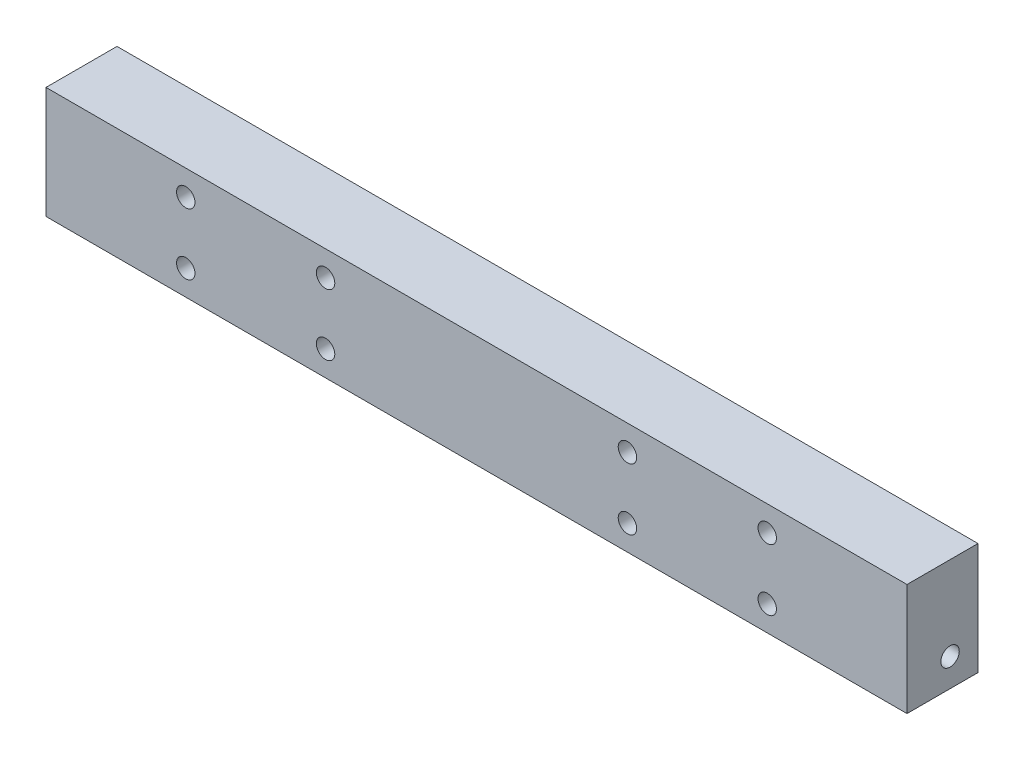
from build123d import *

# Parameters (mm, degrees)
SKETCH1_W           = 154
SKETCH1_H           = 20
BOSS_EXTRUDE1_DEPTH = 12.7
SKETCH2_R           = 1.65
CUT_EXTRUDE1_DEPTH  = 22
SKETCH3_R           = 1.65
CUT_EXTRUDE2_DEPTH  = 79.678396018


with BuildPart() as part:
    # Sketch1 → Boss-Extrude1 (new body)
    with BuildSketch(Plane.XY):
        Rectangle(SKETCH1_W, SKETCH1_H)
    extrude(amount=BOSS_EXTRUDE1_DEPTH)

    # Sketch2 → Cut-Extrude1 (cut)
    with BuildSketch(Plane(origin=(77, 0, 0), x_dir=(0, 0, -1), z_dir=(1, 0, 0))):
        with Locations(Location((-5, -5, 0), (0, 0, 90))):
            Circle(SKETCH2_R)
    cut_extrude1 = extrude(amount=-CUT_EXTRUDE1_DEPTH, mode=Mode.SUBTRACT)

    # Sketch3 → Cut-Extrude2 (cut, through all)
    with BuildSketch(Plane.XY.offset(12.7)):
        with Locations((52, 5.5)):
            Circle(SKETCH3_R)
        with Locations((52, -5.5)):
            Circle(SKETCH3_R)
        with Locations((27, 5.5)):
            Circle(SKETCH3_R)
        with Locations((27, -5.5)):
            Circle(SKETCH3_R)
    cut_extrude2 = extrude(amount=-CUT_EXTRUDE2_DEPTH, mode=Mode.SUBTRACT)

    # Mirror1: Cut-Extrude1, Cut-Extrude2 across plane
    add(cut_extrude1.mirror(Plane(origin=(0, 0, 0), x_dir=(0, 0, 1), z_dir=(1, 0, 0))), mode=Mode.SUBTRACT)
    add(cut_extrude2.mirror(Plane(origin=(0, 0, 0), x_dir=(0, 0, 1), z_dir=(1, 0, 0))), mode=Mode.SUBTRACT)


solid = part.part
